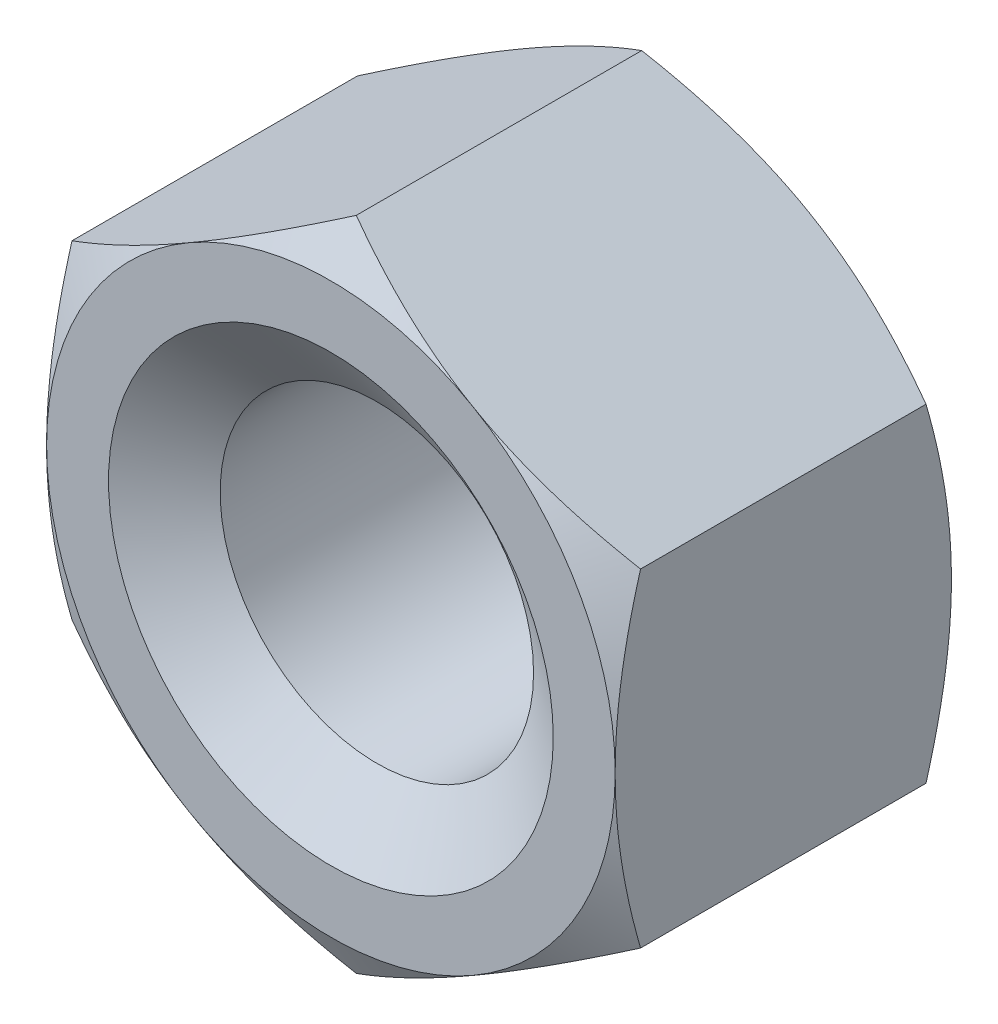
ISO-10303-21;
HEADER;
FILE_DESCRIPTION(('STEP AP214'),'2;1');
FILE_NAME('part.step','',(''),(''),'','','');
FILE_SCHEMA(('AUTOMOTIVE_DESIGN { 1 0 10303 214 1 1 1 1 }'));
ENDSEC;
DATA;
#1=APPLICATION_CONTEXT('core data for automotive mechanical design processes');
#2=APPLICATION_PROTOCOL_DEFINITION('international standard','automotive_design',2000,#1);
#3=PRODUCT_CONTEXT('',#1,'mechanical');
#4=PRODUCT('Part','Part','',(#3));
#5=PRODUCT_RELATED_PRODUCT_CATEGORY('part','',(#4));
#6=PRODUCT_DEFINITION_FORMATION('','',#4);
#7=PRODUCT_DEFINITION_CONTEXT('part definition',#1,'design');
#8=PRODUCT_DEFINITION('design','',#6,#7);
#9=PRODUCT_DEFINITION_SHAPE('','',#8);
#10=(LENGTH_UNIT() NAMED_UNIT(*) SI_UNIT(.MILLI.,.METRE.));
#11=(NAMED_UNIT(*) PLANE_ANGLE_UNIT() SI_UNIT($,.RADIAN.));
#12=(NAMED_UNIT(*) SI_UNIT($,.STERADIAN.) SOLID_ANGLE_UNIT());
#13=UNCERTAINTY_MEASURE_WITH_UNIT(LENGTH_MEASURE(1.E-05),#10,'distance_accuracy_value','');
#14=(GEOMETRIC_REPRESENTATION_CONTEXT(3) GLOBAL_UNCERTAINTY_ASSIGNED_CONTEXT((#13)) GLOBAL_UNIT_ASSIGNED_CONTEXT((#10,
#11,#12)) REPRESENTATION_CONTEXT('',''));
#15=CARTESIAN_POINT('',(0.,0.,0.));
#16=DIRECTION('',(0.,0.,1.));
#17=DIRECTION('',(1.,0.,0.));
#18=AXIS2_PLACEMENT_3D('',#15,#16,#17);
#19=CARTESIAN_POINT('',(0.,0.,-22.5298));
#20=DIRECTION('',(0.,0.,1.));
#21=DIRECTION('',(1.,0.,0.));
#22=AXIS2_PLACEMENT_3D('',#19,#20,#21);
#23=CYLINDRICAL_SURFACE('',#22,10.5);
#24=CARTESIAN_POINT('',(0.,0.,-3.08091316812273));
#25=DIRECTION('',(0.,0.,1.));
#26=DIRECTION('',(1.,0.,0.));
#27=AXIS2_PLACEMENT_3D('',#24,#25,#26);
#28=CIRCLE('',#27,10.5);
#29=CARTESIAN_POINT('',(10.5,0.,-3.08091316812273));
#30=VERTEX_POINT('',#29);
#31=EDGE_CURVE('E149',#30,#30,#28,.F.);
#32=ORIENTED_EDGE('',*,*,#31,.F.);
#33=EDGE_LOOP('',(#32));
#34=FACE_BOUND('',#33,.T.);
#35=CARTESIAN_POINT('',(0.,0.,-19.4234868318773));
#36=DIRECTION('',(0.,0.,-1.));
#37=DIRECTION('',(-1.,0.,0.));
#38=AXIS2_PLACEMENT_3D('',#35,#36,#37);
#39=CIRCLE('',#38,10.5);
#40=CARTESIAN_POINT('',(-10.5,0.,-19.4234868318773));
#41=VERTEX_POINT('',#40);
#42=EDGE_CURVE('E40',#41,#41,#39,.F.);
#43=ORIENTED_EDGE('',*,*,#42,.F.);
#44=EDGE_LOOP('',(#43));
#45=FACE_BOUND('',#44,.T.);
#46=ADVANCED_FACE('F35',(#34,#45),#23,.F.);
#47=CARTESIAN_POINT('',(0.,21.9970452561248,-22.5298));
#48=DIRECTION('',(-0.500000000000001,0.866025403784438,0.));
#49=DIRECTION('',(-0.866025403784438,-0.500000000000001,0.));
#50=AXIS2_PLACEMENT_3D('',#47,#48,#49);
#51=PLANE('',#50);
#52=DIRECTION('',(0.,0.,1.));
#53=VECTOR('',#52,1.);
#54=CARTESIAN_POINT('',(-19.05,10.9985226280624,-22.5298));
#55=LINE('',#54,#53);
#56=CARTESIAN_POINT('',(-19.05,10.9985226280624,-20.8283226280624));
#57=VERTEX_POINT('',#56);
#58=CARTESIAN_POINT('',(-19.05,10.9985226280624,-1.70147737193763));
#59=VERTEX_POINT('',#58);
#60=EDGE_CURVE('E268',#57,#59,#55,.T.);
#61=ORIENTED_EDGE('',*,*,#60,.T.);
#62=CARTESIAN_POINT('',(-19.0502,10.9984071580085,-1.70154403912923));
#63=CARTESIAN_POINT('',(-18.6314889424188,11.2401500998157,-1.56198341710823));
#64=CARTESIAN_POINT('',(-18.2111446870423,11.4828359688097,-1.42875584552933));
#65=CARTESIAN_POINT('',(-17.3670855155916,11.9701537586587,-1.17672716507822));
#66=CARTESIAN_POINT('',(-16.9433695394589,12.2147862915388,-1.05793080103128));
#67=CARTESIAN_POINT('',(-16.0917480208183,12.7064702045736,-0.836361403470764));
#68=CARTESIAN_POINT('',(-15.6638350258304,12.9535258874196,-0.733626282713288));
#69=CARTESIAN_POINT('',(-14.8050356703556,13.4493539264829,-0.546385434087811));
#70=CARTESIAN_POINT('',(-14.374149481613,13.6981261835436,-0.461878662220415));
#71=CARTESIAN_POINT('',(-13.5204444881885,14.1910129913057,-0.314688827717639));
#72=CARTESIAN_POINT('',(-13.0976890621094,14.4350909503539,-0.251518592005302));
#73=CARTESIAN_POINT('',(-12.250241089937,14.9243652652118,-0.14559634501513));
#74=CARTESIAN_POINT('',(-11.8255485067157,15.1695616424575,-0.102844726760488));
#75=CARTESIAN_POINT('',(-10.9754499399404,15.6603662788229,-0.0388391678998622));
#76=CARTESIAN_POINT('',(-10.5500454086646,15.9059736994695,-0.0175596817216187));
#77=CARTESIAN_POINT('',(-9.6988436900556,16.397415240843,0.00304398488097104));
#78=CARTESIAN_POINT('',(-9.27304651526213,16.6432493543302,0.00236884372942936));
#79=CARTESIAN_POINT('',(-8.47700964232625,17.1028414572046,-0.0194033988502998));
#80=CARTESIAN_POINT('',(-8.10671322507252,17.316632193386,-0.0378455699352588));
#81=CARTESIAN_POINT('',(-7.36700369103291,17.7437036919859,-0.0909844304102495));
#82=CARTESIAN_POINT('',(-6.99759056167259,17.9569844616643,-0.125680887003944));
#83=CARTESIAN_POINT('',(-6.25978756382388,18.3829552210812,-0.210726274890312));
#84=CARTESIAN_POINT('',(-5.89139892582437,18.5956445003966,-0.261089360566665));
#85=CARTESIAN_POINT('',(-5.15637533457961,19.0200105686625,-0.376579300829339));
#86=CARTESIAN_POINT('',(-4.78974037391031,19.2316873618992,-0.441706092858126));
#87=CARTESIAN_POINT('',(-3.6767727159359,19.8742595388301,-0.660888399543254));
#88=CARTESIAN_POINT('',(-2.93366305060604,20.3032941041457,-0.836799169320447));
#89=CARTESIAN_POINT('',(-1.45852420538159,21.1549659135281,-1.23604434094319));
#90=CARTESIAN_POINT('',(-0.726476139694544,21.5776140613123,-1.45928498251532));
#91=CARTESIAN_POINT('',(0.000199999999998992,21.9971607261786,-1.70154403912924));
#92=B_SPLINE_CURVE_WITH_KNOTS('',3,(#62,#63,#64,#65,#66,#67,#68,#69,#70,#71,#72,#73,#74,#75,#76,
#77,#78,#79,#80,#81,#82,#83,#84,#85,#86,#87,#88,#89,#90,#91),.UNSPECIFIED.,.F.,.F.,(4,2,2,2,2,2,
2,2,2,2,2,2,2,2,4),(0.,1.50971559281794,3.01992622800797,4.53364959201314,6.04728623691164,
7.52356313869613,8.99986845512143,10.4744153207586,11.9489166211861,13.2325441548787,
14.5161533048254,15.8009255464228,17.085692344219,19.7118183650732,22.3327898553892),.UNSPECIFIED.);
#93=CARTESIAN_POINT('',(-9.52500000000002,16.4977839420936,0.));
#94=VERTEX_POINT('',#93);
#95=EDGE_CURVE('E62',#59,#94,#92,.T.);
#96=ORIENTED_EDGE('',*,*,#95,.T.);
#97=CARTESIAN_POINT('',(0.,21.9970452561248,-1.70147737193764));
#98=VERTEX_POINT('',#97);
#99=EDGE_CURVE('E141',#94,#98,#92,.T.);
#100=ORIENTED_EDGE('',*,*,#99,.T.);
#101=DIRECTION('',(0.,0.,1.));
#102=VECTOR('',#101,1.);
#103=CARTESIAN_POINT('',(0.,21.9970452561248,-22.5298));
#104=LINE('',#103,#102);
#105=CARTESIAN_POINT('',(0.,21.9970452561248,-20.8283226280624));
#106=VERTEX_POINT('',#105);
#107=EDGE_CURVE('E155',#106,#98,#104,.T.);
#108=ORIENTED_EDGE('',*,*,#107,.F.);
#109=CARTESIAN_POINT('',(-19.0502,10.9984071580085,-20.8282559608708));
#110=CARTESIAN_POINT('',(-18.6314889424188,11.2401500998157,-20.9678165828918));
#111=CARTESIAN_POINT('',(-18.2111446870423,11.4828359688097,-21.1010441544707));
#112=CARTESIAN_POINT('',(-17.3670855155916,11.9701537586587,-21.3530728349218));
#113=CARTESIAN_POINT('',(-16.9433695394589,12.2147862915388,-21.4718691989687));
#114=CARTESIAN_POINT('',(-16.0917480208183,12.7064702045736,-21.6934385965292));
#115=CARTESIAN_POINT('',(-15.6638350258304,12.9535258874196,-21.7961737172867));
#116=CARTESIAN_POINT('',(-14.8050356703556,13.4493539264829,-21.9834145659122));
#117=CARTESIAN_POINT('',(-14.374149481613,13.6981261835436,-22.0679213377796));
#118=CARTESIAN_POINT('',(-13.5204444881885,14.1910129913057,-22.2151111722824));
#119=CARTESIAN_POINT('',(-13.0976890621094,14.4350909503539,-22.2782814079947));
#120=CARTESIAN_POINT('',(-12.250241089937,14.9243652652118,-22.3842036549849));
#121=CARTESIAN_POINT('',(-11.8255485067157,15.1695616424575,-22.4269552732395));
#122=CARTESIAN_POINT('',(-10.9754499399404,15.6603662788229,-22.4909608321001));
#123=CARTESIAN_POINT('',(-10.5500454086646,15.9059736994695,-22.5122403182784));
#124=CARTESIAN_POINT('',(-9.6988436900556,16.397415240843,-22.532843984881));
#125=CARTESIAN_POINT('',(-9.27304651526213,16.6432493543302,-22.5321688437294));
#126=CARTESIAN_POINT('',(-8.47700964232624,17.1028414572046,-22.5103966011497));
#127=CARTESIAN_POINT('',(-8.10671322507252,17.316632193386,-22.4919544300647));
#128=CARTESIAN_POINT('',(-7.3670036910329,17.7437036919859,-22.4388155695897));
#129=CARTESIAN_POINT('',(-6.99759056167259,17.9569844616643,-22.4041191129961));
#130=CARTESIAN_POINT('',(-6.25978756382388,18.3829552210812,-22.3190737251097));
#131=CARTESIAN_POINT('',(-5.89139892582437,18.5956445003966,-22.2687106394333));
#132=CARTESIAN_POINT('',(-5.1563753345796,19.0200105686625,-22.1532206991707));
#133=CARTESIAN_POINT('',(-4.7897403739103,19.2316873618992,-22.0880939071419));
#134=CARTESIAN_POINT('',(-3.67677271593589,19.8742595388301,-21.8689116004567));
#135=CARTESIAN_POINT('',(-2.93366305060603,20.3032941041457,-21.6930008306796));
#136=CARTESIAN_POINT('',(-1.45852420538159,21.1549659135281,-21.2937556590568));
#137=CARTESIAN_POINT('',(-0.726476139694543,21.5776140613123,-21.0705150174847));
#138=CARTESIAN_POINT('',(0.000199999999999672,21.9971607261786,-20.8282559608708));
#139=B_SPLINE_CURVE_WITH_KNOTS('',3,(#109,#110,#111,#112,#113,#114,#115,#116,#117,#118,#119,
#120,#121,#122,#123,#124,#125,#126,#127,#128,#129,#130,#131,#132,#133,#134,#135,#136,#137,#138),
.UNSPECIFIED.,.F.,.F.,(4,2,2,2,2,2,2,2,2,2,2,2,2,2,4),(0.,1.50971559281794,3.01992622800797,
4.53364959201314,6.04728623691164,7.52356313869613,8.99986845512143,10.4744153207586,
11.9489166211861,13.2325441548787,14.5161533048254,15.8009255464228,17.085692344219,
19.7118183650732,22.3327898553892),.UNSPECIFIED.);
#140=CARTESIAN_POINT('',(-9.52500000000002,16.4977839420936,-22.5298));
#141=VERTEX_POINT('',#140);
#142=EDGE_CURVE('E247',#141,#106,#139,.T.);
#143=ORIENTED_EDGE('',*,*,#142,.F.);
#144=EDGE_CURVE('E233',#57,#141,#139,.T.);
#145=ORIENTED_EDGE('',*,*,#144,.F.);
#146=EDGE_LOOP('',(#61,#96,#100,#108,#143,#145));
#147=FACE_BOUND('',#146,.T.);
#148=ADVANCED_FACE('F37',(#147),#51,.T.);
#149=CARTESIAN_POINT('',(19.05,10.9985226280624,-22.5298));
#150=DIRECTION('',(0.500000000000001,0.866025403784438,0.));
#151=DIRECTION('',(-0.866025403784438,0.500000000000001,0.));
#152=AXIS2_PLACEMENT_3D('',#149,#150,#151);
#153=PLANE('',#152);
#154=ORIENTED_EDGE('',*,*,#107,.T.);
#155=CARTESIAN_POINT('',(-0.000200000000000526,21.9971607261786,-1.70154403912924));
#156=CARTESIAN_POINT('',(0.418511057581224,21.7554177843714,-1.56198341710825));
#157=CARTESIAN_POINT('',(0.838855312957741,21.5127319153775,-1.42875584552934));
#158=CARTESIAN_POINT('',(1.68291448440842,21.0254141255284,-1.17672716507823));
#159=CARTESIAN_POINT('',(2.10663046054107,20.7807815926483,-1.05793080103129));
#160=CARTESIAN_POINT('',(2.95825197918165,20.2890976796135,-0.836361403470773));
#161=CARTESIAN_POINT('',(3.38616497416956,20.0420419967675,-0.733626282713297));
#162=CARTESIAN_POINT('',(4.24496432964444,19.5462139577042,-0.54638543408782));
#163=CARTESIAN_POINT('',(4.67585051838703,19.2974417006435,-0.461878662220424));
#164=CARTESIAN_POINT('',(5.52955551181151,18.8045548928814,-0.314688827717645));
#165=CARTESIAN_POINT('',(5.95231093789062,18.5604769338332,-0.251518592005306));
#166=CARTESIAN_POINT('',(6.79975891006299,18.0712026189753,-0.145596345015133));
#167=CARTESIAN_POINT('',(7.22445149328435,17.8260062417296,-0.102844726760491));
#168=CARTESIAN_POINT('',(8.07455006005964,17.3352016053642,-0.0388391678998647));
#169=CARTESIAN_POINT('',(8.49995459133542,17.0895941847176,-0.0175596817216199));
#170=CARTESIAN_POINT('',(9.35115630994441,16.5981526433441,0.00304398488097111));
#171=CARTESIAN_POINT('',(9.77695348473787,16.3523185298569,0.00236884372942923));
#172=CARTESIAN_POINT('',(10.5729903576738,15.8927264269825,-0.0194033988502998));
#173=CARTESIAN_POINT('',(10.9432867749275,15.6789356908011,-0.0378455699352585));
#174=CARTESIAN_POINT('',(11.6829963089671,15.2518641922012,-0.0909844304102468));
#175=CARTESIAN_POINT('',(12.0524094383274,15.0385834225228,-0.125680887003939));
#176=CARTESIAN_POINT('',(12.7902124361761,14.612612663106,-0.210726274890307));
#177=CARTESIAN_POINT('',(13.1586010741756,14.3999233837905,-0.261089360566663));
#178=CARTESIAN_POINT('',(13.8936246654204,13.9755573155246,-0.376579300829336));
#179=CARTESIAN_POINT('',(14.2602596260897,13.7638805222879,-0.441706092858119));
#180=CARTESIAN_POINT('',(15.3732272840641,13.121308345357,-0.660888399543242));
#181=CARTESIAN_POINT('',(16.116336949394,12.6922737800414,-0.836799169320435));
#182=CARTESIAN_POINT('',(17.5914757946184,11.840601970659,-1.23604434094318));
#183=CARTESIAN_POINT('',(18.3235238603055,11.4179538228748,-1.45928498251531));
#184=CARTESIAN_POINT('',(19.0502,10.9984071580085,-1.70154403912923));
#185=B_SPLINE_CURVE_WITH_KNOTS('',3,(#155,#156,#157,#158,#159,#160,#161,#162,#163,#164,#165,
#166,#167,#168,#169,#170,#171,#172,#173,#174,#175,#176,#177,#178,#179,#180,#181,#182,#183,#184),
.UNSPECIFIED.,.F.,.F.,(4,2,2,2,2,2,2,2,2,2,2,2,2,2,4),(0.,1.50971559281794,3.01992622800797,
4.53364959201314,6.04728623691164,7.52356313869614,8.99986845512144,10.4744153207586,
11.9489166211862,13.2325441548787,14.5161533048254,15.8009255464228,17.085692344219,
19.7118183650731,22.3327898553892),.UNSPECIFIED.);
#186=CARTESIAN_POINT('',(9.52500000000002,16.4977839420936,0.));
#187=VERTEX_POINT('',#186);
#188=EDGE_CURVE('E136',#98,#187,#185,.T.);
#189=ORIENTED_EDGE('',*,*,#188,.T.);
#190=CARTESIAN_POINT('',(19.05,10.9985226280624,-1.70147737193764));
#191=VERTEX_POINT('',#190);
#192=EDGE_CURVE('E127',#187,#191,#185,.T.);
#193=ORIENTED_EDGE('',*,*,#192,.T.);
#194=DIRECTION('',(0.,0.,1.));
#195=VECTOR('',#194,1.);
#196=CARTESIAN_POINT('',(19.05,10.9985226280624,-22.5298));
#197=LINE('',#196,#195);
#198=CARTESIAN_POINT('',(19.05,10.9985226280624,-20.8283226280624));
#199=VERTEX_POINT('',#198);
#200=EDGE_CURVE('E257',#199,#191,#197,.T.);
#201=ORIENTED_EDGE('',*,*,#200,.F.);
#202=CARTESIAN_POINT('',(-0.000200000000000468,21.9971607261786,-20.8282559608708));
#203=CARTESIAN_POINT('',(0.418511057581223,21.7554177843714,-20.9678165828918));
#204=CARTESIAN_POINT('',(0.838855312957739,21.5127319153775,-21.1010441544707));
#205=CARTESIAN_POINT('',(1.68291448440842,21.0254141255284,-21.3530728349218));
#206=CARTESIAN_POINT('',(2.10663046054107,20.7807815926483,-21.4718691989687));
#207=CARTESIAN_POINT('',(2.95825197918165,20.2890976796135,-21.6934385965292));
#208=CARTESIAN_POINT('',(3.38616497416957,20.0420419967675,-21.7961737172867));
#209=CARTESIAN_POINT('',(4.24496432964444,19.5462139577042,-21.9834145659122));
#210=CARTESIAN_POINT('',(4.67585051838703,19.2974417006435,-22.0679213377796));
#211=CARTESIAN_POINT('',(5.52955551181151,18.8045548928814,-22.2151111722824));
#212=CARTESIAN_POINT('',(5.95231093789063,18.5604769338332,-22.2782814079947));
#213=CARTESIAN_POINT('',(6.79975891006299,18.0712026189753,-22.3842036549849));
#214=CARTESIAN_POINT('',(7.22445149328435,17.8260062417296,-22.4269552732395));
#215=CARTESIAN_POINT('',(8.07455006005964,17.3352016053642,-22.4909608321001));
#216=CARTESIAN_POINT('',(8.49995459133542,17.0895941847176,-22.5122403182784));
#217=CARTESIAN_POINT('',(9.35115630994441,16.5981526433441,-22.532843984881));
#218=CARTESIAN_POINT('',(9.77695348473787,16.3523185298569,-22.5321688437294));
#219=CARTESIAN_POINT('',(10.5729903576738,15.8927264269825,-22.5103966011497));
#220=CARTESIAN_POINT('',(10.9432867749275,15.6789356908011,-22.4919544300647));
#221=CARTESIAN_POINT('',(11.6829963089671,15.2518641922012,-22.4388155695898));
#222=CARTESIAN_POINT('',(12.0524094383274,15.0385834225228,-22.4041191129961));
#223=CARTESIAN_POINT('',(12.7902124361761,14.612612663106,-22.3190737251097));
#224=CARTESIAN_POINT('',(13.1586010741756,14.3999233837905,-22.2687106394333));
#225=CARTESIAN_POINT('',(13.8936246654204,13.9755573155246,-22.1532206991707));
#226=CARTESIAN_POINT('',(14.2602596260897,13.7638805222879,-22.0880939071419));
#227=CARTESIAN_POINT('',(15.3732272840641,13.121308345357,-21.8689116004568));
#228=CARTESIAN_POINT('',(16.116336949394,12.6922737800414,-21.6930008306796));
#229=CARTESIAN_POINT('',(17.5914757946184,11.840601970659,-21.2937556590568));
#230=CARTESIAN_POINT('',(18.3235238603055,11.4179538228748,-21.0705150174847));
#231=CARTESIAN_POINT('',(19.0502,10.9984071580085,-20.8282559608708));
#232=B_SPLINE_CURVE_WITH_KNOTS('',3,(#202,#203,#204,#205,#206,#207,#208,#209,#210,#211,#212,
#213,#214,#215,#216,#217,#218,#219,#220,#221,#222,#223,#224,#225,#226,#227,#228,#229,#230,#231),
.UNSPECIFIED.,.F.,.F.,(4,2,2,2,2,2,2,2,2,2,2,2,2,2,4),(0.,1.50971559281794,3.01992622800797,
4.53364959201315,6.04728623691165,7.52356313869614,8.99986845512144,10.4744153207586,
11.9489166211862,13.2325441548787,14.5161533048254,15.8009255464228,17.085692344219,
19.7118183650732,22.3327898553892),.UNSPECIFIED.);
#233=CARTESIAN_POINT('',(9.52500000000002,16.4977839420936,-22.5298));
#234=VERTEX_POINT('',#233);
#235=EDGE_CURVE('E248',#234,#199,#232,.T.);
#236=ORIENTED_EDGE('',*,*,#235,.F.);
#237=EDGE_CURVE('E254',#106,#234,#232,.T.);
#238=ORIENTED_EDGE('',*,*,#237,.F.);
#239=EDGE_LOOP('',(#154,#189,#193,#201,#236,#238));
#240=FACE_BOUND('',#239,.T.);
#241=ADVANCED_FACE('F152',(#240),#153,.T.);
#242=CARTESIAN_POINT('',(19.05,10.9985226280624,-22.5298));
#243=DIRECTION('',(-1.,0.,0.));
#244=DIRECTION('',(0.,0.,1.));
#245=AXIS2_PLACEMENT_3D('',#242,#243,#244);
#246=PLANE('',#245);
#247=CARTESIAN_POINT('',(19.05,-29.169702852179,-9.11593373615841));
#248=CARTESIAN_POINT('',(19.05,-28.7515170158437,-8.91378890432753));
#249=CARTESIAN_POINT('',(19.05,-28.3328257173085,-8.7126902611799));
#250=CARTESIAN_POINT('',(19.05,-27.494325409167,-8.31282549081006));
#251=CARTESIAN_POINT('',(19.05,-27.0745163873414,-8.11405938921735));
#252=CARTESIAN_POINT('',(19.05,-25.813129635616,-7.52156252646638));
#253=CARTESIAN_POINT('',(19.05,-24.9697281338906,-7.1316990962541));
#254=CARTESIAN_POINT('',(19.05,-23.2722707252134,-6.36257122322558));
#255=CARTESIAN_POINT('',(19.05,-22.4181814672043,-5.98338020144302));
#256=CARTESIAN_POINT('',(19.05,-20.7029839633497,-5.24127883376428));
#257=CARTESIAN_POINT('',(19.05,-19.8418760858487,-4.87836763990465));
#258=CARTESIAN_POINT('',(19.05,-18.1005821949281,-4.16885698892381));
#259=CARTESIAN_POINT('',(19.05,-17.2202917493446,-3.82251248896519));
#260=CARTESIAN_POINT('',(19.05,-15.4493217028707,-3.15694792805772));
#261=CARTESIAN_POINT('',(19.05,-14.5586409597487,-2.83773088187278));
#262=CARTESIAN_POINT('',(19.05,-12.7673320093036,-2.2350028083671));
#263=CARTESIAN_POINT('',(19.05,-11.8667295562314,-1.95141586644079));
#264=CARTESIAN_POINT('',(19.05,-10.0526343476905,-1.42914392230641));
#265=CARTESIAN_POINT('',(19.05,-9.13914576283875,-1.19044473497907));
#266=CARTESIAN_POINT('',(19.05,-7.7590746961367,-0.874799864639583));
#267=CARTESIAN_POINT('',(19.05,-7.29731333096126,-0.776636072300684));
#268=CARTESIAN_POINT('',(19.05,-6.37071732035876,-0.595993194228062));
#269=CARTESIAN_POINT('',(19.05,-5.90588274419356,-0.513513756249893));
#270=CARTESIAN_POINT('',(19.05,-4.97345228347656,-0.36570182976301));
#271=CARTESIAN_POINT('',(19.05,-4.50585623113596,-0.300370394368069));
#272=CARTESIAN_POINT('',(19.05,-3.56843861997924,-0.188166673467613));
#273=CARTESIAN_POINT('',(19.05,-3.09861705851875,-0.141294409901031));
#274=CARTESIAN_POINT('',(19.05,-2.16041609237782,-0.0672708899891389));
#275=CARTESIAN_POINT('',(19.05,-1.69204648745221,-0.0399962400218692));
#276=CARTESIAN_POINT('',(19.05,-0.754574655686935,-0.00531133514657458));
#277=CARTESIAN_POINT('',(19.05,-0.28547244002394,0.00209921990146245));
#278=CARTESIAN_POINT('',(19.05,0.652492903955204,-0.0031198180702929));
#279=CARTESIAN_POINT('',(19.05,1.12135606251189,-0.015743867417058));
#280=CARTESIAN_POINT('',(19.05,2.05813737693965,-0.0607182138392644));
#281=CARTESIAN_POINT('',(19.05,2.52605549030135,-0.0930693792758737));
#282=CARTESIAN_POINT('',(19.05,3.65980250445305,-0.194680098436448));
#283=CARTESIAN_POINT('',(19.05,4.32476458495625,-0.273803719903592));
#284=CARTESIAN_POINT('',(19.05,5.64947952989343,-0.467485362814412));
#285=CARTESIAN_POINT('',(19.05,6.30923160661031,-0.582048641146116));
#286=CARTESIAN_POINT('',(19.05,8.28182382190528,-0.973151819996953));
#287=CARTESIAN_POINT('',(19.05,9.58542312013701,-1.29684470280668));
#288=CARTESIAN_POINT('',(19.05,11.5353898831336,-1.85499845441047));
#289=CARTESIAN_POINT('',(19.05,12.191945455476,-2.05588340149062));
#290=CARTESIAN_POINT('',(19.05,13.498713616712,-2.47768236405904));
#291=CARTESIAN_POINT('',(19.05,14.1489256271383,-2.69859818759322));
#292=CARTESIAN_POINT('',(19.05,15.4397656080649,-3.15575174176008));
#293=CARTESIAN_POINT('',(19.05,16.080426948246,-3.39189604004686));
#294=CARTESIAN_POINT('',(19.05,17.0373840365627,-3.75633654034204));
#295=CARTESIAN_POINT('',(19.05,17.3556458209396,-3.87949985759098));
#296=CARTESIAN_POINT('',(19.05,17.9909330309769,-4.12895791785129));
#297=CARTESIAN_POINT('',(19.05,18.3079584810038,-4.25525259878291));
#298=CARTESIAN_POINT('',(19.05,18.6244086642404,-4.38297164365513));
#299=B_SPLINE_CURVE_WITH_KNOTS('',3,(#247,#248,#249,#250,#251,#252,#253,#254,#255,#256,#257,
#258,#259,#260,#261,#262,#263,#264,#265,#266,#267,#268,#269,#270,#271,#272,#273,#274,#275,#276,
#277,#278,#279,#280,#281,#282,#283,#284,#285,#286,#287,#288,#289,#290,#291,#292,#293,#294,#295,
#296,#297,#298),.UNSPECIFIED.,.F.,.F.,(4,2,2,2,2,2,2,2,2,2,2,2,2,2,2,2,2,2,2,2,2,2,2,2,2,4),(0.,
1.39343811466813,2.78689152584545,5.57425145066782,8.37756231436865,11.1807269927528,
14.0183059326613,16.856199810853,19.6879407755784,22.5187853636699,23.934802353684,
25.3507875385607,26.766859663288,28.1829334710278,29.5900111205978,30.9970675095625,
32.4037346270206,33.8104636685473,35.8182820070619,37.8263983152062,41.8503661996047,
43.9100054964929,45.9698308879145,48.0180400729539,49.0418117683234,50.0655631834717),.UNSPECIFIED.);
#300=CARTESIAN_POINT('',(19.05,-10.9985226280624,-1.70147737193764));
#301=VERTEX_POINT('',#300);
#302=CARTESIAN_POINT('',(19.05,0.,0.));
#303=VERTEX_POINT('',#302);
#304=EDGE_CURVE('E211',#301,#303,#299,.T.);
#305=ORIENTED_EDGE('',*,*,#304,.F.);
#306=DIRECTION('',(0.,0.,1.));
#307=VECTOR('',#306,1.);
#308=CARTESIAN_POINT('',(19.05,-10.9985226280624,-22.5298));
#309=LINE('',#308,#307);
#310=CARTESIAN_POINT('',(19.05,-10.9985226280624,-20.8283226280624));
#311=VERTEX_POINT('',#310);
#312=EDGE_CURVE('E259',#311,#301,#309,.T.);
#313=ORIENTED_EDGE('',*,*,#312,.F.);
#314=CARTESIAN_POINT('',(19.05,-29.169702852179,-13.4138662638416));
#315=CARTESIAN_POINT('',(19.05,-28.7515170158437,-13.6160110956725));
#316=CARTESIAN_POINT('',(19.05,-28.3328257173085,-13.8171097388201));
#317=CARTESIAN_POINT('',(19.05,-27.494325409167,-14.2169745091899));
#318=CARTESIAN_POINT('',(19.05,-27.0745163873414,-14.4157406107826));
#319=CARTESIAN_POINT('',(19.05,-25.813129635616,-15.0082374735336));
#320=CARTESIAN_POINT('',(19.05,-24.9697281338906,-15.3981009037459));
#321=CARTESIAN_POINT('',(19.05,-23.2722707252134,-16.1672287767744));
#322=CARTESIAN_POINT('',(19.05,-22.4181814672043,-16.546419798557));
#323=CARTESIAN_POINT('',(19.05,-20.7029839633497,-17.2885211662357));
#324=CARTESIAN_POINT('',(19.05,-19.8418760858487,-17.6514323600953));
#325=CARTESIAN_POINT('',(19.05,-18.1005821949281,-18.3609430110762));
#326=CARTESIAN_POINT('',(19.05,-17.2202917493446,-18.7072875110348));
#327=CARTESIAN_POINT('',(19.05,-15.4493217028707,-19.3728520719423));
#328=CARTESIAN_POINT('',(19.05,-14.5586409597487,-19.6920691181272));
#329=CARTESIAN_POINT('',(19.05,-12.7673320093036,-20.2947971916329));
#330=CARTESIAN_POINT('',(19.05,-11.8667295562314,-20.5783841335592));
#331=CARTESIAN_POINT('',(19.05,-10.0526343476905,-21.1006560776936));
#332=CARTESIAN_POINT('',(19.05,-9.13914576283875,-21.3393552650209));
#333=CARTESIAN_POINT('',(19.05,-7.7590746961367,-21.6550001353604));
#334=CARTESIAN_POINT('',(19.05,-7.29731333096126,-21.7531639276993));
#335=CARTESIAN_POINT('',(19.05,-6.37071732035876,-21.9338068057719));
#336=CARTESIAN_POINT('',(19.05,-5.90588274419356,-22.0162862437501));
#337=CARTESIAN_POINT('',(19.05,-4.97345228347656,-22.164098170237));
#338=CARTESIAN_POINT('',(19.05,-4.50585623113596,-22.2294296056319));
#339=CARTESIAN_POINT('',(19.05,-3.56843861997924,-22.3416333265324));
#340=CARTESIAN_POINT('',(19.05,-3.09861705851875,-22.388505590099));
#341=CARTESIAN_POINT('',(19.05,-2.16041609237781,-22.4625291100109));
#342=CARTESIAN_POINT('',(19.05,-1.69204648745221,-22.4898037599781));
#343=CARTESIAN_POINT('',(19.05,-0.754574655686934,-22.5244886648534));
#344=CARTESIAN_POINT('',(19.05,-0.285472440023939,-22.5318992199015));
#345=CARTESIAN_POINT('',(19.05,0.652492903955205,-22.5266801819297));
#346=CARTESIAN_POINT('',(19.05,1.12135606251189,-22.5140561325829));
#347=CARTESIAN_POINT('',(19.05,2.05813737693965,-22.4690817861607));
#348=CARTESIAN_POINT('',(19.05,2.52605549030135,-22.4367306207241));
#349=CARTESIAN_POINT('',(19.05,3.65980250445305,-22.3351199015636));
#350=CARTESIAN_POINT('',(19.05,4.32476458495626,-22.2559962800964));
#351=CARTESIAN_POINT('',(19.05,5.64947952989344,-22.0623146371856));
#352=CARTESIAN_POINT('',(19.05,6.30923160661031,-21.9477513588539));
#353=CARTESIAN_POINT('',(19.05,8.28182382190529,-21.556648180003));
#354=CARTESIAN_POINT('',(19.05,9.58542312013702,-21.2329552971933));
#355=CARTESIAN_POINT('',(19.05,11.5353898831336,-20.6748015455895));
#356=CARTESIAN_POINT('',(19.05,12.191945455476,-20.4739165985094));
#357=CARTESIAN_POINT('',(19.05,13.498713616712,-20.052117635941));
#358=CARTESIAN_POINT('',(19.05,14.1489256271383,-19.8312018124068));
#359=CARTESIAN_POINT('',(19.05,15.4397656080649,-19.3740482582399));
#360=CARTESIAN_POINT('',(19.05,16.080426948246,-19.1379039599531));
#361=CARTESIAN_POINT('',(19.05,17.0373840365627,-18.773463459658));
#362=CARTESIAN_POINT('',(19.05,17.3556458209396,-18.650300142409));
#363=CARTESIAN_POINT('',(19.05,17.9909330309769,-18.4008420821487));
#364=CARTESIAN_POINT('',(19.05,18.3079584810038,-18.2745474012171));
#365=CARTESIAN_POINT('',(19.05,18.6244086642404,-18.1468283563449));
#366=B_SPLINE_CURVE_WITH_KNOTS('',3,(#314,#315,#316,#317,#318,#319,#320,#321,#322,#323,#324,
#325,#326,#327,#328,#329,#330,#331,#332,#333,#334,#335,#336,#337,#338,#339,#340,#341,#342,#343,
#344,#345,#346,#347,#348,#349,#350,#351,#352,#353,#354,#355,#356,#357,#358,#359,#360,#361,#362,
#363,#364,#365),.UNSPECIFIED.,.F.,.F.,(4,2,2,2,2,2,2,2,2,2,2,2,2,2,2,2,2,2,2,2,2,2,2,2,2,4),(0.,
1.39343811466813,2.78689152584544,5.57425145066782,8.37756231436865,11.1807269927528,
14.0183059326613,16.856199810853,19.6879407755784,22.5187853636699,23.934802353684,
25.3507875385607,26.766859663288,28.1829334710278,29.5900111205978,30.9970675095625,
32.4037346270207,33.8104636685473,35.8182820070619,37.8263983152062,41.8503661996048,
43.910005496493,45.9698308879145,48.0180400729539,49.0418117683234,50.0655631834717),.UNSPECIFIED.);
#367=CARTESIAN_POINT('',(19.05,0.,-22.5298));
#368=VERTEX_POINT('',#367);
#369=EDGE_CURVE('E225',#311,#368,#366,.T.);
#370=ORIENTED_EDGE('',*,*,#369,.T.);
#371=EDGE_CURVE('E235',#368,#199,#366,.T.);
#372=ORIENTED_EDGE('',*,*,#371,.T.);
#373=ORIENTED_EDGE('',*,*,#200,.T.);
#374=EDGE_CURVE('E131',#303,#191,#299,.T.);
#375=ORIENTED_EDGE('',*,*,#374,.F.);
#376=EDGE_LOOP('',(#305,#313,#370,#372,#373,#375));
#377=FACE_BOUND('',#376,.T.);
#378=ADVANCED_FACE('F217',(#377),#246,.F.);
#379=CARTESIAN_POINT('',(0.,-21.9970452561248,-22.5298));
#380=DIRECTION('',(0.500000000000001,-0.866025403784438,0.));
#381=DIRECTION('',(0.866025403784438,0.500000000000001,0.));
#382=AXIS2_PLACEMENT_3D('',#379,#380,#381);
#383=PLANE('',#382);
#384=ORIENTED_EDGE('',*,*,#312,.T.);
#385=CARTESIAN_POINT('',(19.0502,-10.9984071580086,-1.70154403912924));
#386=CARTESIAN_POINT('',(18.6314889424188,-11.2401500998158,-1.56198341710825));
#387=CARTESIAN_POINT('',(18.2111446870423,-11.4828359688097,-1.42875584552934));
#388=CARTESIAN_POINT('',(17.3670855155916,-11.9701537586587,-1.17672716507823));
#389=CARTESIAN_POINT('',(16.9433695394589,-12.2147862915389,-1.05793080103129));
#390=CARTESIAN_POINT('',(16.0917480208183,-12.7064702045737,-0.836361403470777));
#391=CARTESIAN_POINT('',(15.6638350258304,-12.9535258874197,-0.733626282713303));
#392=CARTESIAN_POINT('',(14.8050356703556,-13.449353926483,-0.546385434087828));
#393=CARTESIAN_POINT('',(14.374149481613,-13.6981261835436,-0.461878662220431));
#394=CARTESIAN_POINT('',(13.5204444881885,-14.1910129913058,-0.314688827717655));
#395=CARTESIAN_POINT('',(13.0976890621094,-14.4350909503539,-0.251518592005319));
#396=CARTESIAN_POINT('',(12.250241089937,-14.9243652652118,-0.145596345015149));
#397=CARTESIAN_POINT('',(11.8255485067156,-15.1695616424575,-0.102844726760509));
#398=CARTESIAN_POINT('',(10.9754499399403,-15.660366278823,-0.0388391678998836));
#399=CARTESIAN_POINT('',(10.5500454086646,-15.9059736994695,-0.0175596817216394));
#400=CARTESIAN_POINT('',(9.69884369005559,-16.3974152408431,0.00304398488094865));
#401=CARTESIAN_POINT('',(9.27304651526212,-16.6432493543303,0.00236884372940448));
#402=CARTESIAN_POINT('',(8.47700964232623,-17.1028414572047,-0.019403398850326));
#403=CARTESIAN_POINT('',(8.10671322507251,-17.3166321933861,-0.0378455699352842));
#404=CARTESIAN_POINT('',(7.36700369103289,-17.743703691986,-0.0909844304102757));
#405=CARTESIAN_POINT('',(6.99759056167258,-17.9569844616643,-0.125680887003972));
#406=CARTESIAN_POINT('',(6.25978756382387,-18.3829552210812,-0.210726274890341));
#407=CARTESIAN_POINT('',(5.89139892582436,-18.5956445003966,-0.261089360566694));
#408=CARTESIAN_POINT('',(5.1563753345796,-19.0200105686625,-0.376579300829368));
#409=CARTESIAN_POINT('',(4.7897403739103,-19.2316873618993,-0.441706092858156));
#410=CARTESIAN_POINT('',(3.67677271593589,-19.8742595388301,-0.660888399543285));
#411=CARTESIAN_POINT('',(2.93366305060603,-20.3032941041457,-0.836799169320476));
#412=CARTESIAN_POINT('',(1.45852420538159,-21.1549659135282,-1.23604434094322));
#413=CARTESIAN_POINT('',(0.72647613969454,-21.5776140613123,-1.45928498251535));
#414=CARTESIAN_POINT('',(-0.000200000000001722,-21.9971607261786,-1.70154403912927));
#415=B_SPLINE_CURVE_WITH_KNOTS('',3,(#385,#386,#387,#388,#389,#390,#391,#392,#393,#394,#395,
#396,#397,#398,#399,#400,#401,#402,#403,#404,#405,#406,#407,#408,#409,#410,#411,#412,#413,#414),
.UNSPECIFIED.,.F.,.F.,(4,2,2,2,2,2,2,2,2,2,2,2,2,2,4),(0.,1.50971559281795,3.01992622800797,
4.53364959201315,6.04728623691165,7.52356313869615,8.99986845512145,10.4744153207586,
11.9489166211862,13.2325441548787,14.5161533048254,15.8009255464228,17.085692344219,
19.7118183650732,22.3327898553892),.UNSPECIFIED.);
#416=CARTESIAN_POINT('',(9.52500000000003,-16.4977839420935,0.));
#417=VERTEX_POINT('',#416);
#418=EDGE_CURVE('E216',#301,#417,#415,.T.);
#419=ORIENTED_EDGE('',*,*,#418,.T.);
#420=CARTESIAN_POINT('',(0.,-21.9970452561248,-1.70147737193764));
#421=VERTEX_POINT('',#420);
#422=EDGE_CURVE('E205',#417,#421,#415,.T.);
#423=ORIENTED_EDGE('',*,*,#422,.T.);
#424=DIRECTION('',(0.,0.,1.));
#425=VECTOR('',#424,1.);
#426=CARTESIAN_POINT('',(0.,-21.9970452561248,-22.5298));
#427=LINE('',#426,#425);
#428=CARTESIAN_POINT('',(0.,-21.9970452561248,-20.8283226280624));
#429=VERTEX_POINT('',#428);
#430=EDGE_CURVE('E262',#429,#421,#427,.T.);
#431=ORIENTED_EDGE('',*,*,#430,.F.);
#432=CARTESIAN_POINT('',(19.0502,-10.9984071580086,-20.8282559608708));
#433=CARTESIAN_POINT('',(18.6314889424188,-11.2401500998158,-20.9678165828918));
#434=CARTESIAN_POINT('',(18.2111446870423,-11.4828359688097,-21.1010441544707));
#435=CARTESIAN_POINT('',(17.3670855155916,-11.9701537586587,-21.3530728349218));
#436=CARTESIAN_POINT('',(16.9433695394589,-12.2147862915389,-21.4718691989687));
#437=CARTESIAN_POINT('',(16.0917480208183,-12.7064702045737,-21.6934385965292));
#438=CARTESIAN_POINT('',(15.6638350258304,-12.9535258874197,-21.7961737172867));
#439=CARTESIAN_POINT('',(14.8050356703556,-13.449353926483,-21.9834145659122));
#440=CARTESIAN_POINT('',(14.374149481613,-13.6981261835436,-22.0679213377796));
#441=CARTESIAN_POINT('',(13.5204444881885,-14.1910129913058,-22.2151111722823));
#442=CARTESIAN_POINT('',(13.0976890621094,-14.4350909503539,-22.2782814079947));
#443=CARTESIAN_POINT('',(12.250241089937,-14.9243652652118,-22.3842036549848));
#444=CARTESIAN_POINT('',(11.8255485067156,-15.1695616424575,-22.4269552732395));
#445=CARTESIAN_POINT('',(10.9754499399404,-15.660366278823,-22.4909608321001));
#446=CARTESIAN_POINT('',(10.5500454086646,-15.9059736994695,-22.5122403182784));
#447=CARTESIAN_POINT('',(9.69884369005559,-16.3974152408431,-22.5328439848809));
#448=CARTESIAN_POINT('',(9.27304651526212,-16.6432493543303,-22.5321688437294));
#449=CARTESIAN_POINT('',(8.47700964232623,-17.1028414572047,-22.5103966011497));
#450=CARTESIAN_POINT('',(8.10671322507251,-17.3166321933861,-22.4919544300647));
#451=CARTESIAN_POINT('',(7.36700369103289,-17.743703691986,-22.4388155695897));
#452=CARTESIAN_POINT('',(6.99759056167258,-17.9569844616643,-22.404119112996));
#453=CARTESIAN_POINT('',(6.25978756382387,-18.3829552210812,-22.3190737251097));
#454=CARTESIAN_POINT('',(5.89139892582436,-18.5956445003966,-22.2687106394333));
#455=CARTESIAN_POINT('',(5.1563753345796,-19.0200105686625,-22.1532206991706));
#456=CARTESIAN_POINT('',(4.7897403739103,-19.2316873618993,-22.0880939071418));
#457=CARTESIAN_POINT('',(3.67677271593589,-19.8742595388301,-21.8689116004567));
#458=CARTESIAN_POINT('',(2.93366305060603,-20.3032941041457,-21.6930008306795));
#459=CARTESIAN_POINT('',(1.45852420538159,-21.1549659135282,-21.2937556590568));
#460=CARTESIAN_POINT('',(0.726476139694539,-21.5776140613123,-21.0705150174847));
#461=CARTESIAN_POINT('',(-0.000200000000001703,-21.9971607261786,-20.8282559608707));
#462=B_SPLINE_CURVE_WITH_KNOTS('',3,(#432,#433,#434,#435,#436,#437,#438,#439,#440,#441,#442,
#443,#444,#445,#446,#447,#448,#449,#450,#451,#452,#453,#454,#455,#456,#457,#458,#459,#460,#461),
.UNSPECIFIED.,.F.,.F.,(4,2,2,2,2,2,2,2,2,2,2,2,2,2,4),(0.,1.50971559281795,3.01992622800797,
4.53364959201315,6.04728623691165,7.52356313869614,8.99986845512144,10.4744153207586,
11.9489166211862,13.2325441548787,14.5161533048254,15.8009255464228,17.085692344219,
19.7118183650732,22.3327898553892),.UNSPECIFIED.);
#463=CARTESIAN_POINT('',(9.52500000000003,-16.4977839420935,-22.5298));
#464=VERTEX_POINT('',#463);
#465=EDGE_CURVE('E236',#464,#429,#462,.T.);
#466=ORIENTED_EDGE('',*,*,#465,.F.);
#467=EDGE_CURVE('E234',#311,#464,#462,.T.);
#468=ORIENTED_EDGE('',*,*,#467,.F.);
#469=EDGE_LOOP('',(#384,#419,#423,#431,#466,#468));
#470=FACE_BOUND('',#469,.T.);
#471=ADVANCED_FACE('F220',(#470),#383,.T.);
#472=CARTESIAN_POINT('',(-19.05,-10.9985226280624,-22.5298));
#473=DIRECTION('',(-0.500000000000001,-0.866025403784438,0.));
#474=DIRECTION('',(0.866025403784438,-0.500000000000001,0.));
#475=AXIS2_PLACEMENT_3D('',#472,#473,#474);
#476=PLANE('',#475);
#477=ORIENTED_EDGE('',*,*,#430,.T.);
#478=CARTESIAN_POINT('',(0.000199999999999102,-21.9971607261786,-1.70154403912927));
#479=CARTESIAN_POINT('',(-0.418511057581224,-21.7554177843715,-1.56198341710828));
#480=CARTESIAN_POINT('',(-0.838855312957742,-21.5127319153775,-1.42875584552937));
#481=CARTESIAN_POINT('',(-1.68291448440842,-21.0254141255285,-1.17672716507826));
#482=CARTESIAN_POINT('',(-2.10663046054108,-20.7807815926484,-1.05793080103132));
#483=CARTESIAN_POINT('',(-2.95825197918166,-20.2890976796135,-0.836361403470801));
#484=CARTESIAN_POINT('',(-3.38616497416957,-20.0420419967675,-0.733626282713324));
#485=CARTESIAN_POINT('',(-4.24496432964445,-19.5462139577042,-0.546385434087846));
#486=CARTESIAN_POINT('',(-4.67585051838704,-19.2974417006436,-0.46187866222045));
#487=CARTESIAN_POINT('',(-5.52955551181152,-18.8045548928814,-0.314688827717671));
#488=CARTESIAN_POINT('',(-5.95231093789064,-18.5604769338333,-0.251518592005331));
#489=CARTESIAN_POINT('',(-6.79975891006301,-18.0712026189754,-0.145596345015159));
#490=CARTESIAN_POINT('',(-7.22445149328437,-17.8260062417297,-0.102844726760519));
#491=CARTESIAN_POINT('',(-8.07455006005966,-17.3352016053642,-0.0388391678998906));
#492=CARTESIAN_POINT('',(-8.49995459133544,-17.0895941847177,-0.0175596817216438));
#493=CARTESIAN_POINT('',(-9.35115630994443,-16.5981526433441,0.00304398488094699));
#494=CARTESIAN_POINT('',(-9.77695348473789,-16.3523185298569,0.0023688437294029));
#495=CARTESIAN_POINT('',(-10.5729903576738,-15.8927264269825,-0.0194033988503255));
#496=CARTESIAN_POINT('',(-10.9432867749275,-15.6789356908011,-0.0378455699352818));
#497=CARTESIAN_POINT('',(-11.6829963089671,-15.2518641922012,-0.0909844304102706));
#498=CARTESIAN_POINT('',(-12.0524094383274,-15.0385834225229,-0.125680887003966));
#499=CARTESIAN_POINT('',(-12.7902124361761,-14.612612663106,-0.210726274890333));
#500=CARTESIAN_POINT('',(-13.1586010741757,-14.3999233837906,-0.261089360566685));
#501=CARTESIAN_POINT('',(-13.8936246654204,-13.9755573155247,-0.376579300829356));
#502=CARTESIAN_POINT('',(-14.2602596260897,-13.7638805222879,-0.441706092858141));
#503=CARTESIAN_POINT('',(-15.3732272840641,-13.1213083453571,-0.660888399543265));
#504=CARTESIAN_POINT('',(-16.116336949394,-12.6922737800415,-0.836799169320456));
#505=CARTESIAN_POINT('',(-17.5914757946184,-11.840601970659,-1.23604434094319));
#506=CARTESIAN_POINT('',(-18.3235238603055,-11.4179538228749,-1.45928498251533));
#507=CARTESIAN_POINT('',(-19.0502,-10.9984071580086,-1.70154403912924));
#508=B_SPLINE_CURVE_WITH_KNOTS('',3,(#478,#479,#480,#481,#482,#483,#484,#485,#486,#487,#488,
#489,#490,#491,#492,#493,#494,#495,#496,#497,#498,#499,#500,#501,#502,#503,#504,#505,#506,#507),
.UNSPECIFIED.,.F.,.F.,(4,2,2,2,2,2,2,2,2,2,2,2,2,2,4),(0.,1.50971559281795,3.01992622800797,
4.53364959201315,6.04728623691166,7.52356313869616,8.99986845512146,10.4744153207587,
11.9489166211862,13.2325441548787,14.5161533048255,15.8009255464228,17.085692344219,
19.7118183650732,22.3327898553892),.UNSPECIFIED.);
#509=CARTESIAN_POINT('',(-9.52500000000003,-16.4977839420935,0.));
#510=VERTEX_POINT('',#509);
#511=EDGE_CURVE('E357',#421,#510,#508,.T.);
#512=ORIENTED_EDGE('',*,*,#511,.T.);
#513=CARTESIAN_POINT('',(-19.05,-10.9985226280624,-1.70147737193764));
#514=VERTEX_POINT('',#513);
#515=EDGE_CURVE('E197',#510,#514,#508,.T.);
#516=ORIENTED_EDGE('',*,*,#515,.T.);
#517=DIRECTION('',(0.,0.,1.));
#518=VECTOR('',#517,1.);
#519=CARTESIAN_POINT('',(-19.05,-10.9985226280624,-22.5298));
#520=LINE('',#519,#518);
#521=CARTESIAN_POINT('',(-19.05,-10.9985226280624,-20.8283226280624));
#522=VERTEX_POINT('',#521);
#523=EDGE_CURVE('E265',#522,#514,#520,.T.);
#524=ORIENTED_EDGE('',*,*,#523,.F.);
#525=CARTESIAN_POINT('',(0.000199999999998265,-21.9971607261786,-20.8282559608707));
#526=CARTESIAN_POINT('',(-0.418511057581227,-21.7554177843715,-20.9678165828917));
#527=CARTESIAN_POINT('',(-0.838855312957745,-21.5127319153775,-21.1010441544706));
#528=CARTESIAN_POINT('',(-1.68291448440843,-21.0254141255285,-21.3530728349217));
#529=CARTESIAN_POINT('',(-2.10663046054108,-20.7807815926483,-21.4718691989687));
#530=CARTESIAN_POINT('',(-2.95825197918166,-20.2890976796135,-21.6934385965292));
#531=CARTESIAN_POINT('',(-3.38616497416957,-20.0420419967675,-21.7961737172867));
#532=CARTESIAN_POINT('',(-4.24496432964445,-19.5462139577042,-21.9834145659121));
#533=CARTESIAN_POINT('',(-4.67585051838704,-19.2974417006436,-22.0679213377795));
#534=CARTESIAN_POINT('',(-5.52955551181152,-18.8045548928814,-22.2151111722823));
#535=CARTESIAN_POINT('',(-5.95231093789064,-18.5604769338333,-22.2782814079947));
#536=CARTESIAN_POINT('',(-6.79975891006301,-18.0712026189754,-22.3842036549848));
#537=CARTESIAN_POINT('',(-7.22445149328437,-17.8260062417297,-22.4269552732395));
#538=CARTESIAN_POINT('',(-8.07455006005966,-17.3352016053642,-22.4909608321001));
#539=CARTESIAN_POINT('',(-8.49995459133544,-17.0895941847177,-22.5122403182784));
#540=CARTESIAN_POINT('',(-9.35115630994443,-16.5981526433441,-22.5328439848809));
#541=CARTESIAN_POINT('',(-9.7769534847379,-16.3523185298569,-22.5321688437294));
#542=CARTESIAN_POINT('',(-10.5729903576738,-15.8927264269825,-22.5103966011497));
#543=CARTESIAN_POINT('',(-10.9432867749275,-15.6789356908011,-22.4919544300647));
#544=CARTESIAN_POINT('',(-11.6829963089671,-15.2518641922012,-22.4388155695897));
#545=CARTESIAN_POINT('',(-12.0524094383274,-15.0385834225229,-22.404119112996));
#546=CARTESIAN_POINT('',(-12.7902124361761,-14.612612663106,-22.3190737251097));
#547=CARTESIAN_POINT('',(-13.1586010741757,-14.3999233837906,-22.2687106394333));
#548=CARTESIAN_POINT('',(-13.8936246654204,-13.9755573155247,-22.1532206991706));
#549=CARTESIAN_POINT('',(-14.2602596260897,-13.7638805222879,-22.0880939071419));
#550=CARTESIAN_POINT('',(-15.3732272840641,-13.1213083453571,-21.8689116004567));
#551=CARTESIAN_POINT('',(-16.116336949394,-12.6922737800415,-21.6930008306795));
#552=CARTESIAN_POINT('',(-17.5914757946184,-11.840601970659,-21.2937556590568));
#553=CARTESIAN_POINT('',(-18.3235238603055,-11.4179538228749,-21.0705150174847));
#554=CARTESIAN_POINT('',(-19.0502,-10.9984071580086,-20.8282559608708));
#555=B_SPLINE_CURVE_WITH_KNOTS('',3,(#525,#526,#527,#528,#529,#530,#531,#532,#533,#534,#535,
#536,#537,#538,#539,#540,#541,#542,#543,#544,#545,#546,#547,#548,#549,#550,#551,#552,#553,#554),
.UNSPECIFIED.,.F.,.F.,(4,2,2,2,2,2,2,2,2,2,2,2,2,2,4),(0.,1.50971559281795,3.01992622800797,
4.53364959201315,6.04728623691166,7.52356313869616,8.99986845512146,10.4744153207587,
11.9489166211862,13.2325441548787,14.5161533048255,15.8009255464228,17.085692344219,
19.7118183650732,22.3327898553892),.UNSPECIFIED.);
#556=CARTESIAN_POINT('',(-9.52500000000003,-16.4977839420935,-22.5298));
#557=VERTEX_POINT('',#556);
#558=EDGE_CURVE('E375',#557,#522,#555,.T.);
#559=ORIENTED_EDGE('',*,*,#558,.F.);
#560=EDGE_CURVE('E395',#429,#557,#555,.T.);
#561=ORIENTED_EDGE('',*,*,#560,.F.);
#562=EDGE_LOOP('',(#477,#512,#516,#524,#559,#561));
#563=FACE_BOUND('',#562,.T.);
#564=ADVANCED_FACE('F304',(#563),#476,.T.);
#565=CARTESIAN_POINT('',(-19.05,10.9985226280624,-22.5298));
#566=DIRECTION('',(-1.,0.,0.));
#567=DIRECTION('',(0.,0.,1.));
#568=AXIS2_PLACEMENT_3D('',#565,#566,#567);
#569=PLANE('',#568);
#570=ORIENTED_EDGE('',*,*,#523,.T.);
#571=CARTESIAN_POINT('',(-19.05,-29.169702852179,-9.11593373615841));
#572=CARTESIAN_POINT('',(-19.05,-28.7515170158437,-8.91378890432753));
#573=CARTESIAN_POINT('',(-19.05,-28.3328257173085,-8.7126902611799));
#574=CARTESIAN_POINT('',(-19.05,-27.494325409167,-8.31282549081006));
#575=CARTESIAN_POINT('',(-19.05,-27.0745163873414,-8.11405938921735));
#576=CARTESIAN_POINT('',(-19.05,-25.813129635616,-7.52156252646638));
#577=CARTESIAN_POINT('',(-19.05,-24.9697281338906,-7.1316990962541));
#578=CARTESIAN_POINT('',(-19.05,-23.2722707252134,-6.36257122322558));
#579=CARTESIAN_POINT('',(-19.05,-22.4181814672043,-5.98338020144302));
#580=CARTESIAN_POINT('',(-19.05,-20.7029839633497,-5.24127883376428));
#581=CARTESIAN_POINT('',(-19.05,-19.8418760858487,-4.87836763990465));
#582=CARTESIAN_POINT('',(-19.05,-18.1005821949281,-4.16885698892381));
#583=CARTESIAN_POINT('',(-19.05,-17.2202917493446,-3.82251248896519));
#584=CARTESIAN_POINT('',(-19.05,-15.4493217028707,-3.15694792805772));
#585=CARTESIAN_POINT('',(-19.05,-14.5586409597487,-2.83773088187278));
#586=CARTESIAN_POINT('',(-19.05,-12.7673320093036,-2.2350028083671));
#587=CARTESIAN_POINT('',(-19.05,-11.8667295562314,-1.95141586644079));
#588=CARTESIAN_POINT('',(-19.05,-10.0526343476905,-1.42914392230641));
#589=CARTESIAN_POINT('',(-19.05,-9.13914576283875,-1.19044473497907));
#590=CARTESIAN_POINT('',(-19.05,-7.7590746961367,-0.874799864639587));
#591=CARTESIAN_POINT('',(-19.05,-7.29731333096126,-0.776636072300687));
#592=CARTESIAN_POINT('',(-19.05,-6.37071732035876,-0.595993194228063));
#593=CARTESIAN_POINT('',(-19.05,-5.90588274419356,-0.513513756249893));
#594=CARTESIAN_POINT('',(-19.05,-4.97345228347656,-0.36570182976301));
#595=CARTESIAN_POINT('',(-19.05,-4.50585623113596,-0.30037039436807));
#596=CARTESIAN_POINT('',(-19.05,-3.56843861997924,-0.188166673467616));
#597=CARTESIAN_POINT('',(-19.05,-3.09861705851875,-0.141294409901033));
#598=CARTESIAN_POINT('',(-19.05,-2.16041609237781,-0.0672708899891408));
#599=CARTESIAN_POINT('',(-19.05,-1.69204648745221,-0.0399962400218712));
#600=CARTESIAN_POINT('',(-19.05,-0.754574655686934,-0.00531133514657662));
#601=CARTESIAN_POINT('',(-19.05,-0.28547244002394,0.00209921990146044));
#602=CARTESIAN_POINT('',(-19.05,0.652492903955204,-0.00311981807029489));
#603=CARTESIAN_POINT('',(-19.05,1.12135606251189,-0.01574386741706));
#604=CARTESIAN_POINT('',(-19.05,2.05813737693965,-0.0607182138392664));
#605=CARTESIAN_POINT('',(-19.05,2.52605549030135,-0.0930693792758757));
#606=CARTESIAN_POINT('',(-19.05,3.65980250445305,-0.19468009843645));
#607=CARTESIAN_POINT('',(-19.05,4.32476458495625,-0.273803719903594));
#608=CARTESIAN_POINT('',(-19.05,5.64947952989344,-0.467485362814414));
#609=CARTESIAN_POINT('',(-19.05,6.30923160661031,-0.582048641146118));
#610=CARTESIAN_POINT('',(-19.05,8.28182382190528,-0.973151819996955));
#611=CARTESIAN_POINT('',(-19.05,9.58542312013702,-1.29684470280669));
#612=CARTESIAN_POINT('',(-19.05,11.5353898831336,-1.85499845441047));
#613=CARTESIAN_POINT('',(-19.05,12.191945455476,-2.05588340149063));
#614=CARTESIAN_POINT('',(-19.05,13.498713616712,-2.47768236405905));
#615=CARTESIAN_POINT('',(-19.05,14.1489256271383,-2.69859818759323));
#616=CARTESIAN_POINT('',(-19.05,15.4397656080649,-3.15575174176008));
#617=CARTESIAN_POINT('',(-19.05,16.0804269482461,-3.39189604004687));
#618=CARTESIAN_POINT('',(-19.05,17.0373840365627,-3.75633654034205));
#619=CARTESIAN_POINT('',(-19.05,17.3556458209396,-3.87949985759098));
#620=CARTESIAN_POINT('',(-19.05,17.9909330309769,-4.12895791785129));
#621=CARTESIAN_POINT('',(-19.05,18.3079584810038,-4.25525259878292));
#622=CARTESIAN_POINT('',(-19.05,18.6244086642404,-4.38297164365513));
#623=B_SPLINE_CURVE_WITH_KNOTS('',3,(#571,#572,#573,#574,#575,#576,#577,#578,#579,#580,#581,
#582,#583,#584,#585,#586,#587,#588,#589,#590,#591,#592,#593,#594,#595,#596,#597,#598,#599,#600,
#601,#602,#603,#604,#605,#606,#607,#608,#609,#610,#611,#612,#613,#614,#615,#616,#617,#618,#619,
#620,#621,#622),.UNSPECIFIED.,.F.,.F.,(4,2,2,2,2,2,2,2,2,2,2,2,2,2,2,2,2,2,2,2,2,2,2,2,2,4),(0.,
1.39343811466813,2.78689152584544,5.57425145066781,8.37756231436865,11.1807269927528,
14.0183059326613,16.856199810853,19.6879407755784,22.5187853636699,23.934802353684,
25.3507875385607,26.766859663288,28.1829334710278,29.5900111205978,30.9970675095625,
32.4037346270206,33.8104636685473,35.8182820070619,37.8263983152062,41.8503661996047,
43.9100054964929,45.9698308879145,48.0180400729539,49.0418117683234,50.0655631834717),.UNSPECIFIED.);
#624=CARTESIAN_POINT('',(-19.05,0.,0.));
#625=VERTEX_POINT('',#624);
#626=EDGE_CURVE('E349',#514,#625,#623,.T.);
#627=ORIENTED_EDGE('',*,*,#626,.T.);
#628=EDGE_CURVE('E148',#625,#59,#623,.T.);
#629=ORIENTED_EDGE('',*,*,#628,.T.);
#630=ORIENTED_EDGE('',*,*,#60,.F.);
#631=CARTESIAN_POINT('',(-19.05,-29.169702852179,-13.4138662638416));
#632=CARTESIAN_POINT('',(-19.05,-28.7515170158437,-13.6160110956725));
#633=CARTESIAN_POINT('',(-19.05,-28.3328257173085,-13.8171097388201));
#634=CARTESIAN_POINT('',(-19.05,-27.494325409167,-14.2169745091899));
#635=CARTESIAN_POINT('',(-19.05,-27.0745163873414,-14.4157406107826));
#636=CARTESIAN_POINT('',(-19.05,-25.813129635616,-15.0082374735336));
#637=CARTESIAN_POINT('',(-19.05,-24.9697281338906,-15.3981009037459));
#638=CARTESIAN_POINT('',(-19.05,-23.2722707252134,-16.1672287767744));
#639=CARTESIAN_POINT('',(-19.05,-22.4181814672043,-16.546419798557));
#640=CARTESIAN_POINT('',(-19.05,-20.7029839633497,-17.2885211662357));
#641=CARTESIAN_POINT('',(-19.05,-19.8418760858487,-17.6514323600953));
#642=CARTESIAN_POINT('',(-19.05,-18.1005821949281,-18.3609430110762));
#643=CARTESIAN_POINT('',(-19.05,-17.2202917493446,-18.7072875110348));
#644=CARTESIAN_POINT('',(-19.05,-15.4493217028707,-19.3728520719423));
#645=CARTESIAN_POINT('',(-19.05,-14.5586409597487,-19.6920691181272));
#646=CARTESIAN_POINT('',(-19.05,-12.7673320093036,-20.2947971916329));
#647=CARTESIAN_POINT('',(-19.05,-11.8667295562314,-20.5783841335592));
#648=CARTESIAN_POINT('',(-19.05,-10.0526343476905,-21.1006560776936));
#649=CARTESIAN_POINT('',(-19.05,-9.13914576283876,-21.3393552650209));
#650=CARTESIAN_POINT('',(-19.05,-7.75907469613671,-21.6550001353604));
#651=CARTESIAN_POINT('',(-19.05,-7.29731333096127,-21.7531639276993));
#652=CARTESIAN_POINT('',(-19.05,-6.37071732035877,-21.9338068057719));
#653=CARTESIAN_POINT('',(-19.05,-5.90588274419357,-22.0162862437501));
#654=CARTESIAN_POINT('',(-19.05,-4.97345228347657,-22.164098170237));
#655=CARTESIAN_POINT('',(-19.05,-4.50585623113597,-22.2294296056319));
#656=CARTESIAN_POINT('',(-19.05,-3.56843861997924,-22.3416333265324));
#657=CARTESIAN_POINT('',(-19.05,-3.09861705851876,-22.388505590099));
#658=CARTESIAN_POINT('',(-19.05,-2.16041609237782,-22.4625291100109));
#659=CARTESIAN_POINT('',(-19.05,-1.69204648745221,-22.4898037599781));
#660=CARTESIAN_POINT('',(-19.05,-0.754574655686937,-22.5244886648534));
#661=CARTESIAN_POINT('',(-19.05,-0.285472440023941,-22.5318992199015));
#662=CARTESIAN_POINT('',(-19.05,0.652492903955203,-22.5266801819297));
#663=CARTESIAN_POINT('',(-19.05,1.12135606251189,-22.5140561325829));
#664=CARTESIAN_POINT('',(-19.05,2.05813737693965,-22.4690817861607));
#665=CARTESIAN_POINT('',(-19.05,2.52605549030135,-22.4367306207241));
#666=CARTESIAN_POINT('',(-19.05,3.65980250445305,-22.3351199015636));
#667=CARTESIAN_POINT('',(-19.05,4.32476458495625,-22.2559962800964));
#668=CARTESIAN_POINT('',(-19.05,5.64947952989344,-22.0623146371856));
#669=CARTESIAN_POINT('',(-19.05,6.30923160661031,-21.9477513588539));
#670=CARTESIAN_POINT('',(-19.05,8.28182382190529,-21.556648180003));
#671=CARTESIAN_POINT('',(-19.05,9.58542312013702,-21.2329552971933));
#672=CARTESIAN_POINT('',(-19.05,11.5353898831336,-20.6748015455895));
#673=CARTESIAN_POINT('',(-19.05,12.191945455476,-20.4739165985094));
#674=CARTESIAN_POINT('',(-19.05,13.498713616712,-20.052117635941));
#675=CARTESIAN_POINT('',(-19.05,14.1489256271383,-19.8312018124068));
#676=CARTESIAN_POINT('',(-19.05,15.4397656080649,-19.3740482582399));
#677=CARTESIAN_POINT('',(-19.05,16.0804269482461,-19.1379039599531));
#678=CARTESIAN_POINT('',(-19.05,17.0373840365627,-18.773463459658));
#679=CARTESIAN_POINT('',(-19.05,17.3556458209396,-18.650300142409));
#680=CARTESIAN_POINT('',(-19.05,17.9909330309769,-18.4008420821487));
#681=CARTESIAN_POINT('',(-19.05,18.3079584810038,-18.2745474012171));
#682=CARTESIAN_POINT('',(-19.05,18.6244086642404,-18.1468283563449));
#683=B_SPLINE_CURVE_WITH_KNOTS('',3,(#631,#632,#633,#634,#635,#636,#637,#638,#639,#640,#641,
#642,#643,#644,#645,#646,#647,#648,#649,#650,#651,#652,#653,#654,#655,#656,#657,#658,#659,#660,
#661,#662,#663,#664,#665,#666,#667,#668,#669,#670,#671,#672,#673,#674,#675,#676,#677,#678,#679,
#680,#681,#682),.UNSPECIFIED.,.F.,.F.,(4,2,2,2,2,2,2,2,2,2,2,2,2,2,2,2,2,2,2,2,2,2,2,2,2,4),(0.,
1.39343811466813,2.78689152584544,5.57425145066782,8.37756231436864,11.1807269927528,
14.0183059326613,16.856199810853,19.6879407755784,22.5187853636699,23.934802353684,
25.3507875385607,26.766859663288,28.1829334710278,29.5900111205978,30.9970675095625,
32.4037346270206,33.8104636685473,35.8182820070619,37.8263983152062,41.8503661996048,
43.910005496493,45.9698308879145,48.0180400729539,49.0418117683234,50.0655631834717),.UNSPECIFIED.);
#684=CARTESIAN_POINT('',(-19.05,0.,-22.5298));
#685=VERTEX_POINT('',#684);
#686=EDGE_CURVE('E370',#685,#57,#683,.T.);
#687=ORIENTED_EDGE('',*,*,#686,.F.);
#688=EDGE_CURVE('E372',#522,#685,#683,.T.);
#689=ORIENTED_EDGE('',*,*,#688,.F.);
#690=EDGE_LOOP('',(#570,#627,#629,#630,#687,#689));
#691=FACE_BOUND('',#690,.T.);
#692=ADVANCED_FACE('F296',(#691),#569,.T.);
#693=CARTESIAN_POINT('',(-38.1,0.,0.));
#694=DIRECTION('',(0.,0.,1.));
#695=DIRECTION('',(1.,0.,0.));
#696=AXIS2_PLACEMENT_3D('',#693,#694,#695);
#697=PLANE('',#696);
#698=CARTESIAN_POINT('',(0.,0.,0.));
#699=DIRECTION('',(0.,0.,1.));
#700=DIRECTION('',(1.,0.,0.));
#701=AXIS2_PLACEMENT_3D('',#698,#699,#700);
#702=CIRCLE('',#701,14.9);
#703=CARTESIAN_POINT('',(14.9,0.,0.));
#704=VERTEX_POINT('',#703);
#705=EDGE_CURVE('E277',#704,#704,#702,.T.);
#706=ORIENTED_EDGE('',*,*,#705,.F.);
#707=EDGE_LOOP('',(#706));
#708=FACE_BOUND('',#707,.T.);
#709=CARTESIAN_POINT('',(0.,0.,0.));
#710=DIRECTION('',(0.,0.,1.));
#711=DIRECTION('',(1.,0.,0.));
#712=AXIS2_PLACEMENT_3D('',#709,#710,#711);
#713=CIRCLE('',#712,19.05);
#714=EDGE_CURVE('E47',#417,#303,#713,.T.);
#715=ORIENTED_EDGE('',*,*,#714,.T.);
#716=CARTESIAN_POINT('',(0.,0.,0.));
#717=DIRECTION('',(0.,0.,1.));
#718=DIRECTION('',(1.,0.,0.));
#719=AXIS2_PLACEMENT_3D('',#716,#717,#718);
#720=CIRCLE('',#719,19.05);
#721=EDGE_CURVE('E54',#303,#187,#720,.T.);
#722=ORIENTED_EDGE('',*,*,#721,.T.);
#723=EDGE_CURVE('E11',#187,#94,#713,.T.);
#724=ORIENTED_EDGE('',*,*,#723,.T.);
#725=EDGE_CURVE('E45',#94,#625,#713,.T.);
#726=ORIENTED_EDGE('',*,*,#725,.T.);
#727=EDGE_CURVE('E351',#625,#510,#713,.T.);
#728=ORIENTED_EDGE('',*,*,#727,.T.);
#729=EDGE_CURVE('E275',#510,#417,#713,.T.);
#730=ORIENTED_EDGE('',*,*,#729,.T.);
#731=EDGE_LOOP('',(#715,#722,#724,#726,#728,#730));
#732=FACE_BOUND('',#731,.T.);
#733=ADVANCED_FACE('F145',(#708,#732),#697,.T.);
#734=CARTESIAN_POINT('',(-38.1,0.,-22.5298));
#735=DIRECTION('',(0.,0.,1.));
#736=DIRECTION('',(1.,0.,0.));
#737=AXIS2_PLACEMENT_3D('',#734,#735,#736);
#738=PLANE('',#737);
#739=CARTESIAN_POINT('',(0.,0.,-22.5298));
#740=DIRECTION('',(0.,0.,1.));
#741=DIRECTION('',(1.,0.,0.));
#742=AXIS2_PLACEMENT_3D('',#739,#740,#741);
#743=CIRCLE('',#742,14.9);
#744=CARTESIAN_POINT('',(14.9,0.,-22.5298));
#745=VERTEX_POINT('',#744);
#746=EDGE_CURVE('E278',#745,#745,#743,.F.);
#747=ORIENTED_EDGE('',*,*,#746,.F.);
#748=EDGE_LOOP('',(#747));
#749=FACE_BOUND('',#748,.T.);
#750=CARTESIAN_POINT('',(0.,0.,-22.5298));
#751=DIRECTION('',(0.,0.,1.));
#752=DIRECTION('',(1.,0.,0.));
#753=AXIS2_PLACEMENT_3D('',#750,#751,#752);
#754=CIRCLE('',#753,19.05);
#755=EDGE_CURVE('E156',#368,#234,#754,.T.);
#756=ORIENTED_EDGE('',*,*,#755,.F.);
#757=CARTESIAN_POINT('',(0.,0.,-22.5298));
#758=DIRECTION('',(0.,0.,1.));
#759=DIRECTION('',(1.,0.,0.));
#760=AXIS2_PLACEMENT_3D('',#757,#758,#759);
#761=CIRCLE('',#760,19.05);
#762=EDGE_CURVE('E271',#368,#464,#761,.F.);
#763=ORIENTED_EDGE('',*,*,#762,.T.);
#764=EDGE_CURVE('E273',#464,#557,#761,.F.);
#765=ORIENTED_EDGE('',*,*,#764,.T.);
#766=EDGE_CURVE('E401',#557,#685,#761,.F.);
#767=ORIENTED_EDGE('',*,*,#766,.T.);
#768=EDGE_CURVE('E405',#685,#141,#761,.F.);
#769=ORIENTED_EDGE('',*,*,#768,.T.);
#770=EDGE_CURVE('E256',#141,#234,#761,.F.);
#771=ORIENTED_EDGE('',*,*,#770,.T.);
#772=EDGE_LOOP('',(#756,#763,#765,#767,#769,#771));
#773=FACE_BOUND('',#772,.T.);
#774=ADVANCED_FACE('F295',(#749,#773),#738,.F.);
#775=CARTESIAN_POINT('',(0.,0.,-22.5298));
#776=DIRECTION('',(0.,0.,1.));
#777=DIRECTION('',(1.,0.,0.));
#778=AXIS2_PLACEMENT_3D('',#775,#776,#777);
#779=CONICAL_SURFACE('',#778,19.05,1.0471975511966);
#780=ORIENTED_EDGE('',*,*,#235,.T.);
#781=ORIENTED_EDGE('',*,*,#371,.F.);
#782=ORIENTED_EDGE('',*,*,#755,.T.);
#783=EDGE_LOOP('',(#780,#781,#782));
#784=FACE_BOUND('',#783,.T.);
#785=ADVANCED_FACE('F301',(#784),#779,.T.);
#786=ORIENTED_EDGE('',*,*,#142,.T.);
#787=ORIENTED_EDGE('',*,*,#237,.T.);
#788=ORIENTED_EDGE('',*,*,#770,.F.);
#789=EDGE_LOOP('',(#786,#787,#788));
#790=FACE_BOUND('',#789,.T.);
#791=ADVANCED_FACE('F411',(#790),#779,.T.);
#792=ORIENTED_EDGE('',*,*,#144,.T.);
#793=ORIENTED_EDGE('',*,*,#768,.F.);
#794=ORIENTED_EDGE('',*,*,#686,.T.);
#795=EDGE_LOOP('',(#792,#793,#794));
#796=FACE_BOUND('',#795,.T.);
#797=ADVANCED_FACE('F342',(#796),#779,.T.);
#798=ORIENTED_EDGE('',*,*,#558,.T.);
#799=ORIENTED_EDGE('',*,*,#688,.T.);
#800=ORIENTED_EDGE('',*,*,#766,.F.);
#801=EDGE_LOOP('',(#798,#799,#800));
#802=FACE_BOUND('',#801,.T.);
#803=ADVANCED_FACE('F184',(#802),#779,.T.);
#804=ORIENTED_EDGE('',*,*,#465,.T.);
#805=ORIENTED_EDGE('',*,*,#560,.T.);
#806=ORIENTED_EDGE('',*,*,#764,.F.);
#807=EDGE_LOOP('',(#804,#805,#806));
#808=FACE_BOUND('',#807,.T.);
#809=ADVANCED_FACE('F340',(#808),#779,.T.);
#810=ORIENTED_EDGE('',*,*,#467,.T.);
#811=ORIENTED_EDGE('',*,*,#762,.F.);
#812=ORIENTED_EDGE('',*,*,#369,.F.);
#813=EDGE_LOOP('',(#810,#811,#812));
#814=FACE_BOUND('',#813,.T.);
#815=ADVANCED_FACE('F333',(#814),#779,.T.);
#816=CARTESIAN_POINT('',(0.,0.,0.));
#817=DIRECTION('',(0.,0.,-1.));
#818=DIRECTION('',(-1.,0.,0.));
#819=AXIS2_PLACEMENT_3D('',#816,#817,#818);
#820=CONICAL_SURFACE('',#819,19.05,1.0471975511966);
#821=ORIENTED_EDGE('',*,*,#304,.T.);
#822=ORIENTED_EDGE('',*,*,#714,.F.);
#823=ORIENTED_EDGE('',*,*,#418,.F.);
#824=EDGE_LOOP('',(#821,#822,#823));
#825=FACE_BOUND('',#824,.T.);
#826=ADVANCED_FACE('F328',(#825),#820,.T.);
#827=ORIENTED_EDGE('',*,*,#729,.F.);
#828=ORIENTED_EDGE('',*,*,#511,.F.);
#829=ORIENTED_EDGE('',*,*,#422,.F.);
#830=EDGE_LOOP('',(#827,#828,#829));
#831=FACE_BOUND('',#830,.T.);
#832=ADVANCED_FACE('F180',(#831),#820,.T.);
#833=ORIENTED_EDGE('',*,*,#727,.F.);
#834=ORIENTED_EDGE('',*,*,#626,.F.);
#835=ORIENTED_EDGE('',*,*,#515,.F.);
#836=EDGE_LOOP('',(#833,#834,#835));
#837=FACE_BOUND('',#836,.T.);
#838=ADVANCED_FACE('F174',(#837),#820,.T.);
#839=ORIENTED_EDGE('',*,*,#628,.F.);
#840=ORIENTED_EDGE('',*,*,#725,.F.);
#841=ORIENTED_EDGE('',*,*,#95,.F.);
#842=EDGE_LOOP('',(#839,#840,#841));
#843=FACE_BOUND('',#842,.T.);
#844=ADVANCED_FACE('F179',(#843),#820,.T.);
#845=ORIENTED_EDGE('',*,*,#723,.F.);
#846=ORIENTED_EDGE('',*,*,#188,.F.);
#847=ORIENTED_EDGE('',*,*,#99,.F.);
#848=EDGE_LOOP('',(#845,#846,#847));
#849=FACE_BOUND('',#848,.T.);
#850=ADVANCED_FACE('F139',(#849),#820,.T.);
#851=ORIENTED_EDGE('',*,*,#721,.F.);
#852=ORIENTED_EDGE('',*,*,#374,.T.);
#853=ORIENTED_EDGE('',*,*,#192,.F.);
#854=EDGE_LOOP('',(#851,#852,#853));
#855=FACE_BOUND('',#854,.T.);
#856=ADVANCED_FACE('F129',(#855),#820,.T.);
#857=CARTESIAN_POINT('',(0.,0.,-3.38900448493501));
#858=DIRECTION('',(0.,0.,1.));
#859=DIRECTION('',(1.,0.,0.));
#860=AXIS2_PLACEMENT_3D('',#857,#858,#859);
#861=CONICAL_SURFACE('',#860,10.06,0.95993108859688);
#862=ORIENTED_EDGE('',*,*,#705,.T.);
#863=EDGE_LOOP('',(#862));
#864=FACE_BOUND('',#863,.T.);
#865=ORIENTED_EDGE('',*,*,#31,.T.);
#866=EDGE_LOOP('',(#865));
#867=FACE_BOUND('',#866,.T.);
#868=ADVANCED_FACE('F182',(#864,#867),#861,.F.);
#869=CARTESIAN_POINT('',(0.,0.,-22.5044));
#870=DIRECTION('',(0.,0.,-1.));
#871=DIRECTION('',(-1.,0.,0.));
#872=AXIS2_PLACEMENT_3D('',#869,#870,#871);
#873=CONICAL_SURFACE('',#872,14.9,0.95993108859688);
#874=CARTESIAN_POINT('',(0.,0.,-22.5044));
#875=DIRECTION('',(0.,0.,1.));
#876=DIRECTION('',(1.,0.,0.));
#877=AXIS2_PLACEMENT_3D('',#874,#875,#876);
#878=CIRCLE('',#877,14.9);
#879=CARTESIAN_POINT('',(14.9,0.,-22.5044));
#880=VERTEX_POINT('',#879);
#881=EDGE_CURVE('E280',#880,#880,#878,.T.);
#882=ORIENTED_EDGE('',*,*,#881,.F.);
#883=EDGE_LOOP('',(#882));
#884=FACE_BOUND('',#883,.T.);
#885=ORIENTED_EDGE('',*,*,#42,.T.);
#886=EDGE_LOOP('',(#885));
#887=FACE_BOUND('',#886,.T.);
#888=ADVANCED_FACE('F316',(#884,#887),#873,.F.);
#889=CARTESIAN_POINT('',(0.,0.,-25.0375057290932));
#890=DIRECTION('',(0.,0.,1.));
#891=DIRECTION('',(1.,0.,0.));
#892=AXIS2_PLACEMENT_3D('',#889,#890,#891);
#893=CYLINDRICAL_SURFACE('',#892,14.9);
#894=ORIENTED_EDGE('',*,*,#881,.T.);
#895=EDGE_LOOP('',(#894));
#896=FACE_BOUND('',#895,.T.);
#897=ORIENTED_EDGE('',*,*,#746,.T.);
#898=EDGE_LOOP('',(#897));
#899=FACE_BOUND('',#898,.T.);
#900=ADVANCED_FACE('F318',(#896,#899),#893,.F.);
#901=CLOSED_SHELL('',(#46,#148,#241,#378,#471,#564,#692,#733,#774,#785,#791,#797,#803,#809,#815,
#826,#832,#838,#844,#850,#856,#868,#888,#900));
#902=MANIFOLD_SOLID_BREP('B2',#901);
#903=ADVANCED_BREP_SHAPE_REPRESENTATION('',(#18,#902),#14);
#904=SHAPE_DEFINITION_REPRESENTATION(#9,#903);
ENDSEC;
END-ISO-10303-21;
